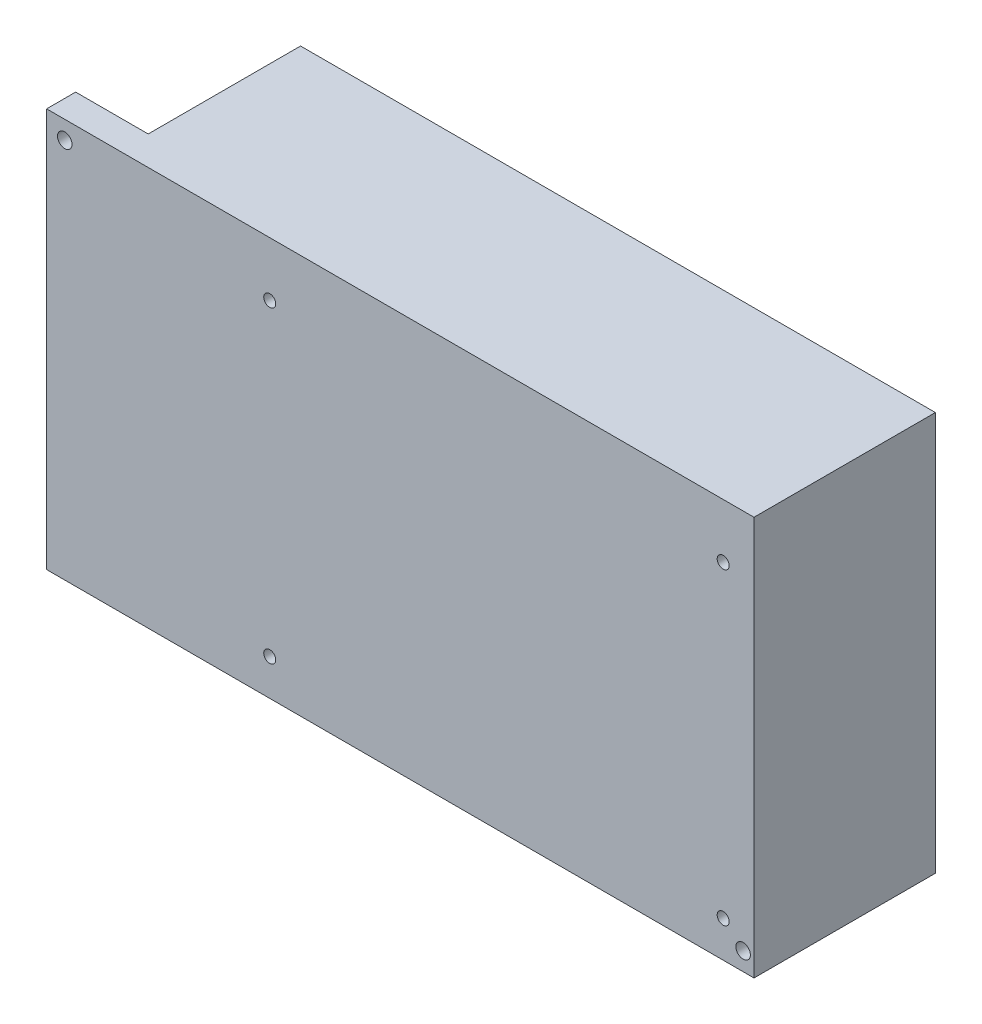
from build123d import *

# Parameters (mm, degrees)
SZKIC1_W                    = 195
SZKIC1_H                    = 110
DODANIE_WYCI_GNI_CIE1_DEPTH = 50
SZKIC2_R                    = 2
WYTNIJ_WYCI_GNI_CIE1_DEPTH  = 10
SZKIC3_W                    = 42
SZKIC3_H                    = 110
WYTNIJ_WYCI_GNI_CIE2_DEPTH  = 20
OTW_R_GWINTOWANY_M41_D      = 3.3
OTW_R_GWINTOWANY_M41_DEPTH  = 10.508579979
OTW_R_GWINTOWANY_M41_TIP    = 0.991420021


with BuildPart() as part:
    # Szkic1 → Dodanie-wyci_gni_cie1 (new body)
    with BuildSketch(Plane.XY):
        with Locations((97.5, 55)):
            Rectangle(SZKIC1_W, SZKIC1_H)
    extrude(amount=DODANIE_WYCI_GNI_CIE1_DEPTH)

    # Szkic2 → Wytnij-wyci_gni_cie1 (cut)
    with BuildSketch(Plane.XY.offset(50)):
        with Locations((5, 105)):
            Circle(SZKIC2_R)
        with Locations((192, 5)):
            Circle(SZKIC2_R)
    extrude(amount=-WYTNIJ_WYCI_GNI_CIE1_DEPTH, mode=Mode.SUBTRACT)

    # Szkic3 → Wytnij-wyci_gni_cie2 (cut)
    with BuildSketch(Plane.ZY):
        with Locations((21, 55)):
            Rectangle(SZKIC3_W, SZKIC3_H)
    extrude(amount=-WYTNIJ_WYCI_GNI_CIE2_DEPTH, mode=Mode.SUBTRACT)

    # Otw_r gwintowany M41
    with Locations(Plane.XY.offset(50)):
        with Locations((186.5, 10), (186.5, 95), (61.5, 95), (61.5, 10)):
            Hole(OTW_R_GWINTOWANY_M41_D / 2, depth=OTW_R_GWINTOWANY_M41_DEPTH)
            with Locations((0, 0, -(OTW_R_GWINTOWANY_M41_DEPTH + OTW_R_GWINTOWANY_M41_TIP / 2))):  # 118° drill point
                Cone(0, OTW_R_GWINTOWANY_M41_D / 2, OTW_R_GWINTOWANY_M41_TIP, mode=Mode.SUBTRACT)


solid = part.part
